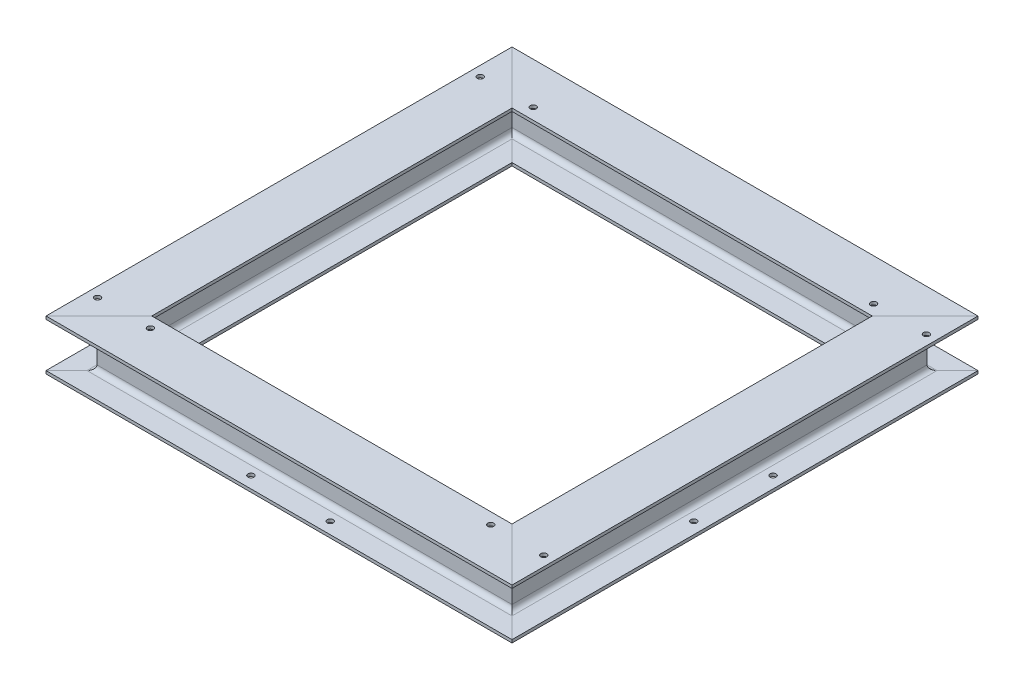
from build123d import *

# Parameters (mm, degrees)
HEA_S_RIE_CONOMIQUE_HE_160_A_1_DEPTH   = 1250
HEA_S_RIE_CONOMIQUE_HE_160_A_1_2_DEPTH = 1250
HEA_S_RIE_CONOMIQUE_HE_160_A_1_3_DEPTH = 1008.222916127
HEA_S_RIE_CONOMIQUE_HE_160_A_1_4_DEPTH = 1008.222916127
PART_RUN_ON_DEPTH                      = 80
BODY_3_RUN_ON_DEPTH                    = 200.888542
BODY_START                             = 1008.222916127
BODY_3_RUN_ON_2_DEPTH                  = 200.888542
BODY_2_RUN_ON_DEPTH                    = 80
BODY_START_2                           = 1250
BODY_2_RUN_ON_2_DEPTH                  = 80
BODY_4_RUN_ON_DEPTH                    = 135.581375
BODY_4_RUN_ON_2_DEPTH                  = 266.195709
PART_START                             = 1250
PART_RUN_ON_2_DEPTH                    = 80
ESQUISSE13_R                           = 9
ENL_V_MAT_EXTRU_1_DEPTH                = 10
SYM_TRIE2_COPY_1_SKETCH_R              = 9
SYM_TRIE2_COPY_1_DEPTH                 = 10
ESQUISSE14_R                           = 9
ENL_V_MAT_EXTRU_2_DEPTH                = 10


with BuildPart() as part:
    # Esquisse12 → Hea s_rie _conomique HE 160 A_1 (new body)
    with BuildSketch(Plane(origin=(-625, 0, -625), x_dir=(1, 0, 0), z_dir=(0, 0, 1))):
        with BuildLine():
            Line((-80, 76), (80, 76))
            Line((80, 76), (80, 67))
            Line((80, 67), (18, 67))
            ThreePointArc((18, 67), (7.393398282, 62.606601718), (3, 52))
            Line((3, 52), (3, -52))
            ThreePointArc((3, -52), (7.393398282, -62.606601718), (18, -67))
            Line((18, -67), (80, -67))
            Line((80, -67), (80, -76))
            Line((80, -76), (-80, -76))
            Line((-80, -76), (-80, -67))
            Line((-80, -67), (-18, -67))
            ThreePointArc((-18, -67), (-7.393398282, -62.606601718), (-3, -52))
            Line((-3, -52), (-3, 52))
            ThreePointArc((-3, 52), (-7.393398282, 62.606601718), (-18, 67))
            Line((-18, 67), (-80, 67))
            Line((-80, 67), (-80, 76))
        make_face()
    extrude(amount=HEA_S_RIE_CONOMIQUE_HE_160_A_1_DEPTH)

    # Esquisse12 → part run on (add)
    with BuildSketch(Plane(origin=(-625, 0, -625), x_dir=(1, 0, 0), z_dir=(0, 0, 1))):
        with BuildLine():
            Line((-80, 76), (80, 76))
            Line((80, 76), (80, 67))
            Line((80, 67), (18, 67))
            ThreePointArc((18, 67), (7.393398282, 62.606601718), (3, 52))
            Line((3, 52), (3, -52))
            ThreePointArc((3, -52), (7.393398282, -62.606601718), (18, -67))
            Line((18, -67), (80, -67))
            Line((80, -67), (80, -76))
            Line((80, -76), (-80, -76))
            Line((-80, -76), (-80, -67))
            Line((-80, -67), (-18, -67))
            ThreePointArc((-18, -67), (-7.393398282, -62.606601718), (-3, -52))
            Line((-3, -52), (-3, 52))
            ThreePointArc((-3, 52), (-7.393398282, 62.606601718), (-18, 67))
            Line((-18, 67), (-80, 67))
            Line((-80, 67), (-80, 76))
        make_face()
    extrude(amount=-PART_RUN_ON_DEPTH)

    # Ajuster_Prolonger1
    split(bisect_by=Plane(origin=(-625, 0, -625), x_dir=(0, -1, 0), z_dir=(-0.707106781, 0, 0.707106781)), keep=Keep.TOP)

    # Esquisse12 → part run on 2 (add)
    with BuildSketch(Plane(origin=(-625, 0, -625), x_dir=(1, 0, 0), z_dir=(0, 0, 1)).offset(PART_START)):
        with BuildLine():
            Line((-80, 76), (80, 76))
            Line((80, 76), (80, 67))
            Line((80, 67), (18, 67))
            ThreePointArc((18, 67), (7.393398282, 62.606601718), (3, 52))
            Line((3, 52), (3, -52))
            ThreePointArc((3, -52), (7.393398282, -62.606601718), (18, -67))
            Line((18, -67), (80, -67))
            Line((80, -67), (80, -76))
            Line((80, -76), (-80, -76))
            Line((-80, -76), (-80, -67))
            Line((-80, -67), (-18, -67))
            ThreePointArc((-18, -67), (-7.393398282, -62.606601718), (-3, -52))
            Line((-3, -52), (-3, 52))
            ThreePointArc((-3, 52), (-7.393398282, 62.606601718), (-18, 67))
            Line((-18, 67), (-80, 67))
            Line((-80, 67), (-80, 76))
        make_face()
    extrude(amount=PART_RUN_ON_2_DEPTH)

    # Ajuster_Prolonger4
    split(bisect_by=Plane(origin=(-625, 0, 625), x_dir=(0, -1, 0), z_dir=(-0.707106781, 0, -0.707106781)), keep=Keep.TOP)


with BuildPart() as body_2:
    # Esquisse12 on segment 2 (on carried to segment 2) → Hea s_rie _conomique HE 160 A_1 2 (new body)
    with BuildSketch(Plane(origin=(625, 0, -625), x_dir=(1, 0, 0), z_dir=(0, 0, 1))):
        with BuildLine():
            Line((-80, 76), (80, 76))
            Line((80, 76), (80, 67))
            Line((80, 67), (18, 67))
            ThreePointArc((18, 67), (7.393398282, 62.606601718), (3, 52))
            Line((3, 52), (3, -52))
            ThreePointArc((3, -52), (7.393398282, -62.606601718), (18, -67))
            Line((18, -67), (80, -67))
            Line((80, -67), (80, -76))
            Line((80, -76), (-80, -76))
            Line((-80, -76), (-80, -67))
            Line((-80, -67), (-18, -67))
            ThreePointArc((-18, -67), (-7.393398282, -62.606601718), (-3, -52))
            Line((-3, -52), (-3, 52))
            ThreePointArc((-3, 52), (-7.393398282, 62.606601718), (-18, 67))
            Line((-18, 67), (-80, 67))
            Line((-80, 67), (-80, 76))
        make_face()
    extrude(amount=HEA_S_RIE_CONOMIQUE_HE_160_A_1_2_DEPTH)

    # Esquisse12 on segment 2 (on carried to segment 2) → body 2 run on (add)
    with BuildSketch(Plane(origin=(625, 0, -625), x_dir=(1, 0, 0), z_dir=(0, 0, 1))):
        with BuildLine():
            Line((-80, 76), (80, 76))
            Line((80, 76), (80, 67))
            Line((80, 67), (18, 67))
            ThreePointArc((18, 67), (7.393398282, 62.606601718), (3, 52))
            Line((3, 52), (3, -52))
            ThreePointArc((3, -52), (7.393398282, -62.606601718), (18, -67))
            Line((18, -67), (80, -67))
            Line((80, -67), (80, -76))
            Line((80, -76), (-80, -76))
            Line((-80, -76), (-80, -67))
            Line((-80, -67), (-18, -67))
            ThreePointArc((-18, -67), (-7.393398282, -62.606601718), (-3, -52))
            Line((-3, -52), (-3, 52))
            ThreePointArc((-3, 52), (-7.393398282, 62.606601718), (-18, 67))
            Line((-18, 67), (-80, 67))
            Line((-80, 67), (-80, 76))
        make_face()
    extrude(amount=-BODY_2_RUN_ON_DEPTH)

    # Ajuster_Prolonger2
    split(bisect_by=Plane(origin=(625, 0, -625), x_dir=(0, 1, 0), z_dir=(0.707106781, 0, 0.707106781)), keep=Keep.TOP)

    # Esquisse12 on segment 2 (on carried to segment 2) → body 2 run on 2 (add)
    with BuildSketch(Plane(origin=(625, 0, -625), x_dir=(1, 0, 0), z_dir=(0, 0, 1)).offset(BODY_START_2)):
        with BuildLine():
            Line((-80, 76), (80, 76))
            Line((80, 76), (80, 67))
            Line((80, 67), (18, 67))
            ThreePointArc((18, 67), (7.393398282, 62.606601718), (3, 52))
            Line((3, 52), (3, -52))
            ThreePointArc((3, -52), (7.393398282, -62.606601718), (18, -67))
            Line((18, -67), (80, -67))
            Line((80, -67), (80, -76))
            Line((80, -76), (-80, -76))
            Line((-80, -76), (-80, -67))
            Line((-80, -67), (-18, -67))
            ThreePointArc((-18, -67), (-7.393398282, -62.606601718), (-3, -52))
            Line((-3, -52), (-3, 52))
            ThreePointArc((-3, 52), (-7.393398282, 62.606601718), (-18, 67))
            Line((-18, 67), (-80, 67))
            Line((-80, 67), (-80, 76))
        make_face()
    extrude(amount=BODY_2_RUN_ON_2_DEPTH)

    # Ajuster_Prolonger3
    split(bisect_by=Plane(origin=(625, 0, 625), x_dir=(0, 1, 0), z_dir=(0.707106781, 0, -0.707106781)), keep=Keep.TOP)


with BuildPart() as body_3:
    # Esquisse12 on segment 3 (on carried to segment 3) → Hea s_rie _conomique HE 160 A_1 3 (new body)
    with BuildSketch(Plane(origin=(-504.111458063, 0, -625), x_dir=(0, 0, -1), z_dir=(1, 0, 0))):
        with BuildLine():
            Line((-80, 76), (80, 76))
            Line((80, 76), (80, 67))
            Line((80, 67), (18, 67))
            ThreePointArc((18, 67), (7.393398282, 62.606601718), (3, 52))
            Line((3, 52), (3, -52))
            ThreePointArc((3, -52), (7.393398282, -62.606601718), (18, -67))
            Line((18, -67), (80, -67))
            Line((80, -67), (80, -76))
            Line((80, -76), (-80, -76))
            Line((-80, -76), (-80, -67))
            Line((-80, -67), (-18, -67))
            ThreePointArc((-18, -67), (-7.393398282, -62.606601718), (-3, -52))
            Line((-3, -52), (-3, 52))
            ThreePointArc((-3, 52), (-7.393398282, 62.606601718), (-18, 67))
            Line((-18, 67), (-80, 67))
            Line((-80, 67), (-80, 76))
        make_face()
    extrude(amount=HEA_S_RIE_CONOMIQUE_HE_160_A_1_3_DEPTH)

    # Esquisse12 on segment 3 (on carried to segment 3) → body 3 run on (add)
    with BuildSketch(Plane(origin=(-504.111458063, 0, -625), x_dir=(0, 0, -1), z_dir=(1, 0, 0))):
        with BuildLine():
            Line((-80, 76), (80, 76))
            Line((80, 76), (80, 67))
            Line((80, 67), (18, 67))
            ThreePointArc((18, 67), (7.393398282, 62.606601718), (3, 52))
            Line((3, 52), (3, -52))
            ThreePointArc((3, -52), (7.393398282, -62.606601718), (18, -67))
            Line((18, -67), (80, -67))
            Line((80, -67), (80, -76))
            Line((80, -76), (-80, -76))
            Line((-80, -76), (-80, -67))
            Line((-80, -67), (-18, -67))
            ThreePointArc((-18, -67), (-7.393398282, -62.606601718), (-3, -52))
            Line((-3, -52), (-3, 52))
            ThreePointArc((-3, 52), (-7.393398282, 62.606601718), (-18, 67))
            Line((-18, 67), (-80, 67))
            Line((-80, 67), (-80, 76))
        make_face()
    extrude(amount=-BODY_3_RUN_ON_DEPTH)

    # Ajuster_Prolonger1
    split(bisect_by=Plane(origin=(-625, 0, -625), x_dir=(0, 1, 0), z_dir=(0.707106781, 0, -0.707106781)), keep=Keep.TOP)

    # Esquisse12 on segment 3 (on carried to segment 3) → body 3 run on 2 (add)
    with BuildSketch(Plane(origin=(-504.111458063, 0, -625), x_dir=(0, 0, -1), z_dir=(1, 0, 0)).offset(BODY_START)):
        with BuildLine():
            Line((-80, 76), (80, 76))
            Line((80, 76), (80, 67))
            Line((80, 67), (18, 67))
            ThreePointArc((18, 67), (7.393398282, 62.606601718), (3, 52))
            Line((3, 52), (3, -52))
            ThreePointArc((3, -52), (7.393398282, -62.606601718), (18, -67))
            Line((18, -67), (80, -67))
            Line((80, -67), (80, -76))
            Line((80, -76), (-80, -76))
            Line((-80, -76), (-80, -67))
            Line((-80, -67), (-18, -67))
            ThreePointArc((-18, -67), (-7.393398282, -62.606601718), (-3, -52))
            Line((-3, -52), (-3, 52))
            ThreePointArc((-3, 52), (-7.393398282, 62.606601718), (-18, 67))
            Line((-18, 67), (-80, 67))
            Line((-80, 67), (-80, 76))
        make_face()
    extrude(amount=BODY_3_RUN_ON_2_DEPTH)

    # Ajuster_Prolonger2
    split(bisect_by=Plane(origin=(625, 0, -625), x_dir=(0, -1, 0), z_dir=(-0.707106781, 0, -0.707106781)), keep=Keep.TOP)


with BuildPart() as body_4:
    # Esquisse12 on segment 4 (on carried to segment 4) → Hea s_rie _conomique HE 160 A_1 4 (new body)
    with BuildSketch(Plane(origin=(-438.804290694, 0, 625), x_dir=(0, 0, -1), z_dir=(1, 0, 0))):
        with BuildLine():
            Line((-80, 76), (80, 76))
            Line((80, 76), (80, 67))
            Line((80, 67), (18, 67))
            ThreePointArc((18, 67), (7.393398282, 62.606601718), (3, 52))
            Line((3, 52), (3, -52))
            ThreePointArc((3, -52), (7.393398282, -62.606601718), (18, -67))
            Line((18, -67), (80, -67))
            Line((80, -67), (80, -76))
            Line((80, -76), (-80, -76))
            Line((-80, -76), (-80, -67))
            Line((-80, -67), (-18, -67))
            ThreePointArc((-18, -67), (-7.393398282, -62.606601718), (-3, -52))
            Line((-3, -52), (-3, 52))
            ThreePointArc((-3, 52), (-7.393398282, 62.606601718), (-18, 67))
            Line((-18, 67), (-80, 67))
            Line((-80, 67), (-80, 76))
        make_face()
    extrude(amount=HEA_S_RIE_CONOMIQUE_HE_160_A_1_4_DEPTH)

    # Esquisse12 on segment 4 (on carried to segment 4) → body 4 run on (add)
    with BuildSketch(Plane(origin=(-438.804290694, 0, 625), x_dir=(0, 0, -1), z_dir=(1, 0, 0)).offset(BODY_START)):
        with BuildLine():
            Line((-80, 76), (80, 76))
            Line((80, 76), (80, 67))
            Line((80, 67), (18, 67))
            ThreePointArc((18, 67), (7.393398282, 62.606601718), (3, 52))
            Line((3, 52), (3, -52))
            ThreePointArc((3, -52), (7.393398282, -62.606601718), (18, -67))
            Line((18, -67), (80, -67))
            Line((80, -67), (80, -76))
            Line((80, -76), (-80, -76))
            Line((-80, -76), (-80, -67))
            Line((-80, -67), (-18, -67))
            ThreePointArc((-18, -67), (-7.393398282, -62.606601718), (-3, -52))
            Line((-3, -52), (-3, 52))
            ThreePointArc((-3, 52), (-7.393398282, 62.606601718), (-18, 67))
            Line((-18, 67), (-80, 67))
            Line((-80, 67), (-80, 76))
        make_face()
    extrude(amount=BODY_4_RUN_ON_DEPTH)

    # Ajuster_Prolonger3
    split(bisect_by=Plane(origin=(625, 0, 625), x_dir=(0, -1, 0), z_dir=(-0.707106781, 0, 0.707106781)), keep=Keep.TOP)

    # Esquisse12 on segment 4 (on carried to segment 4) → body 4 run on 2 (add)
    with BuildSketch(Plane(origin=(-438.804290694, 0, 625), x_dir=(0, 0, -1), z_dir=(1, 0, 0))):
        with BuildLine():
            Line((-80, 76), (80, 76))
            Line((80, 76), (80, 67))
            Line((80, 67), (18, 67))
            ThreePointArc((18, 67), (7.393398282, 62.606601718), (3, 52))
            Line((3, 52), (3, -52))
            ThreePointArc((3, -52), (7.393398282, -62.606601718), (18, -67))
            Line((18, -67), (80, -67))
            Line((80, -67), (80, -76))
            Line((80, -76), (-80, -76))
            Line((-80, -76), (-80, -67))
            Line((-80, -67), (-18, -67))
            ThreePointArc((-18, -67), (-7.393398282, -62.606601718), (-3, -52))
            Line((-3, -52), (-3, 52))
            ThreePointArc((-3, 52), (-7.393398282, 62.606601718), (-18, 67))
            Line((-18, 67), (-80, 67))
            Line((-80, 67), (-80, 76))
        make_face()
    extrude(amount=-BODY_4_RUN_ON_2_DEPTH)

    # Ajuster_Prolonger4
    split(bisect_by=Plane(origin=(-625, 0, 625), x_dir=(0, 1, 0), z_dir=(0.707106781, 0, 0.707106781)), keep=Keep.TOP)


with BuildPart() as enl_v_mat_extru_1_tool:
    # Esquisse13 → Enl_v. mat.-Extru.1 (new body)
    with BuildSketch(Plane(origin=(0, 76, 0), x_dir=(1, 0, 0), z_dir=(0, 1, 0))):
        with Locations(Location((515, 579, 0), (0, 0, 180))):
            Circle(ESQUISSE13_R)
        with Locations(Location((675, 579, 0), (0, 0, 180))):
            Circle(ESQUISSE13_R)
    enl_v_mat_extru_1 = extrude(amount=-ENL_V_MAT_EXTRU_1_DEPTH)


with BuildPart() as body_2_1:
    add(body_2.part)

    # Enl_v. mat.-Extru.1: cut by enl_v_mat_extru_1_tool
    add(enl_v_mat_extru_1_tool.part, mode=Mode.SUBTRACT)


with BuildPart() as body_3_1:
    add(body_3.part)

    # Enl_v. mat.-Extru.1: cut by enl_v_mat_extru_1_tool
    add(enl_v_mat_extru_1_tool.part, mode=Mode.SUBTRACT)


with BuildPart() as sym_trie1_tool:
    # Sym_trie1: Enl_v. mat.-Extru.1 across plane
    add(enl_v_mat_extru_1.mirror(Plane(origin=(0, 0, 0), x_dir=(0, 0, 1), z_dir=(1, 0, 0))))


with BuildPart() as part_1:
    add(part.part)

    # Sym_trie1: cut by sym_trie1_tool
    add(sym_trie1_tool.part, mode=Mode.SUBTRACT)


with BuildPart() as body_3_2:
    add(body_3_1.part)

    # Sym_trie1: cut by sym_trie1_tool
    add(sym_trie1_tool.part, mode=Mode.SUBTRACT)


with BuildPart() as sym_trie2_tool:
    # Sym_trie2: Enl_v. mat.-Extru.1 across plane
    add(enl_v_mat_extru_1.mirror(Plane.XY))


with BuildPart() as body_2_2:
    add(body_2_1.part)

    # Sym_trie2: cut by sym_trie2_tool
    add(sym_trie2_tool.part, mode=Mode.SUBTRACT)


with BuildPart() as body_4_1:
    add(body_4.part)

    # Sym_trie2: cut by sym_trie2_tool
    add(sym_trie2_tool.part, mode=Mode.SUBTRACT)


with BuildPart() as sym_trie2_copy_1_tool:
    # Sym_trie2 copy 1 sketch → Sym_trie2 copy 1 (new body)
    with BuildSketch(Plane(origin=(0, 76, 0), x_dir=(-1, 0, 0), z_dir=(0, 1, 0))):
        with Locations(Location((515, 579, 0), (0, 0, 180))):
            Circle(SYM_TRIE2_COPY_1_SKETCH_R)
        with Locations(Location((675, 579, 0), (0, 0, 180))):
            Circle(SYM_TRIE2_COPY_1_SKETCH_R)
    extrude(amount=-SYM_TRIE2_COPY_1_DEPTH)


with BuildPart() as part_2:
    add(part_1.part)

    # Sym_trie2 copy 1: cut by sym_trie2_copy_1_tool
    add(sym_trie2_copy_1_tool.part, mode=Mode.SUBTRACT)


with BuildPart() as body_4_2:
    add(body_4_1.part)

    # Sym_trie2 copy 1: cut by sym_trie2_copy_1_tool
    add(sym_trie2_copy_1_tool.part, mode=Mode.SUBTRACT)


with BuildPart() as enl_v_mat_extru_2_tool:
    # Esquisse14 → Enl_v. mat.-Extru.2 (new body)
    with BuildSketch(Plane(origin=(0, -76, 0), x_dir=(-1, 0, 0), z_dir=(0, -1, 0))):
        with Locations(Location((120, -670, 0), (0, 0, 90))):
            Circle(ESQUISSE14_R)
        with Locations(Location((-120, -670, 0), (0, 0, 90))):
            Circle(ESQUISSE14_R)
        with Locations(Location((-670, 120, 0), (0, 0, 90))):
            Circle(ESQUISSE14_R)
        with Locations(Location((-670, -120, 0), (0, 0, 90))):
            Circle(ESQUISSE14_R)
        with Locations(Location((120, 670, 0), (0, 0, 90))):
            Circle(ESQUISSE14_R)
        with Locations(Location((-120, 670, 0), (0, 0, 90))):
            Circle(ESQUISSE14_R)
        with Locations(Location((670, -120, 0), (0, 0, 90))):
            Circle(ESQUISSE14_R)
        with Locations(Location((670, 120, 0), (0, 0, 90))):
            Circle(ESQUISSE14_R)
    extrude(amount=-ENL_V_MAT_EXTRU_2_DEPTH)


with BuildPart() as part_3:
    add(part_2.part)

    # Enl_v. mat.-Extru.2: cut by enl_v_mat_extru_2_tool
    add(enl_v_mat_extru_2_tool.part, mode=Mode.SUBTRACT)


with BuildPart() as body_2_3:
    add(body_2_2.part)

    # Enl_v. mat.-Extru.2: cut by enl_v_mat_extru_2_tool
    add(enl_v_mat_extru_2_tool.part, mode=Mode.SUBTRACT)


with BuildPart() as body_3_3:
    add(body_3_2.part)

    # Enl_v. mat.-Extru.2: cut by enl_v_mat_extru_2_tool
    add(enl_v_mat_extru_2_tool.part, mode=Mode.SUBTRACT)


with BuildPart() as body_4_3:
    add(body_4_2.part)

    # Enl_v. mat.-Extru.2: cut by enl_v_mat_extru_2_tool
    add(enl_v_mat_extru_2_tool.part, mode=Mode.SUBTRACT)


solid = Compound([part_3.part, body_2_3.part, body_3_3.part, body_4_3.part])
